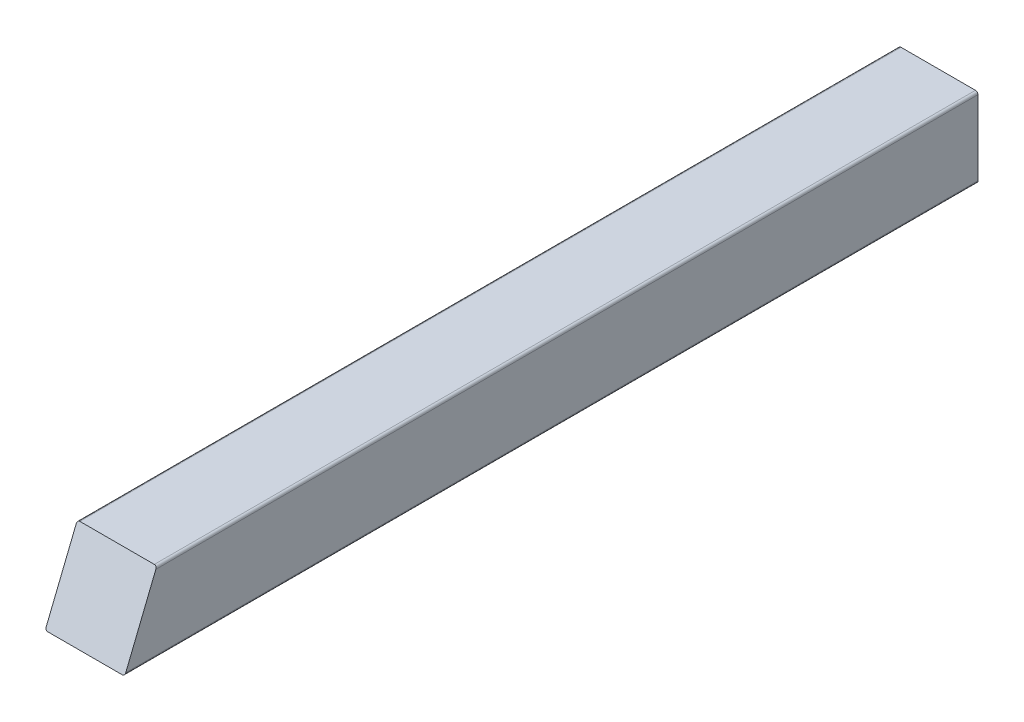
ISO-10303-21;
HEADER;
FILE_DESCRIPTION(('STEP AP214'),'2;1');
FILE_NAME('part.step','',(''),(''),'','','');
FILE_SCHEMA(('AUTOMOTIVE_DESIGN { 1 0 10303 214 1 1 1 1 }'));
ENDSEC;
DATA;
#1=APPLICATION_CONTEXT('core data for automotive mechanical design processes');
#2=APPLICATION_PROTOCOL_DEFINITION('international standard','automotive_design',2000,#1);
#3=PRODUCT_CONTEXT('',#1,'mechanical');
#4=PRODUCT('Part','Part','',(#3));
#5=PRODUCT_RELATED_PRODUCT_CATEGORY('part','',(#4));
#6=PRODUCT_DEFINITION_FORMATION('','',#4);
#7=PRODUCT_DEFINITION_CONTEXT('part definition',#1,'design');
#8=PRODUCT_DEFINITION('design','',#6,#7);
#9=PRODUCT_DEFINITION_SHAPE('','',#8);
#10=(LENGTH_UNIT() NAMED_UNIT(*) SI_UNIT(.MILLI.,.METRE.));
#11=(NAMED_UNIT(*) PLANE_ANGLE_UNIT() SI_UNIT($,.RADIAN.));
#12=(NAMED_UNIT(*) SI_UNIT($,.STERADIAN.) SOLID_ANGLE_UNIT());
#13=UNCERTAINTY_MEASURE_WITH_UNIT(LENGTH_MEASURE(1.E-05),#10,'distance_accuracy_value','');
#14=(GEOMETRIC_REPRESENTATION_CONTEXT(3) GLOBAL_UNCERTAINTY_ASSIGNED_CONTEXT((#13)) GLOBAL_UNIT_ASSIGNED_CONTEXT((#10,
#11,#12)) REPRESENTATION_CONTEXT('',''));
#15=CARTESIAN_POINT('',(0.,0.,0.));
#16=DIRECTION('',(0.,0.,1.));
#17=DIRECTION('',(1.,0.,0.));
#18=AXIS2_PLACEMENT_3D('',#15,#16,#17);
#19=CARTESIAN_POINT('',(47.5,-47.5,1139.62587109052));
#20=DIRECTION('',(-1.,0.,0.));
#21=DIRECTION('',(0.,-1.,0.));
#22=AXIS2_PLACEMENT_3D('',#19,#20,#21);
#23=PLANE('',#22);
#24=DIRECTION('',(0.,1.,0.));
#25=VECTOR('',#24,1.);
#26=CARTESIAN_POINT('',(47.5,-47.5,0.));
#27=LINE('',#26,#25);
#28=CARTESIAN_POINT('',(47.5,-44.5,0.));
#29=VERTEX_POINT('',#28);
#30=CARTESIAN_POINT('',(47.5,44.5,0.));
#31=VERTEX_POINT('',#30);
#32=EDGE_CURVE('E161',#29,#31,#27,.T.);
#33=ORIENTED_EDGE('',*,*,#32,.T.);
#34=DIRECTION('',(0.,0.,-1.));
#35=VECTOR('',#34,1.);
#36=CARTESIAN_POINT('',(47.5,44.5,1139.62587109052));
#37=LINE('',#36,#35);
#38=CARTESIAN_POINT('',(47.5,44.5,982.020832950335));
#39=VERTEX_POINT('',#38);
#40=EDGE_CURVE('E128',#31,#39,#37,.F.);
#41=ORIENTED_EDGE('',*,*,#40,.T.);
#42=DIRECTION('',(0.,0.927183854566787,-0.374606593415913));
#43=VECTOR('',#42,1.);
#44=CARTESIAN_POINT('',(47.5,-89.3304603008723,1036.09184872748));
#45=LINE('',#44,#43);
#46=CARTESIAN_POINT('',(47.5,-44.5,1017.97916704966));
#47=VERTEX_POINT('',#46);
#48=EDGE_CURVE('E97',#47,#39,#45,.T.);
#49=ORIENTED_EDGE('',*,*,#48,.F.);
#50=DIRECTION('',(0.,0.,-1.));
#51=VECTOR('',#50,1.);
#52=CARTESIAN_POINT('',(47.5,-44.5,1139.62587109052));
#53=LINE('',#52,#51);
#54=EDGE_CURVE('E125',#47,#29,#53,.T.);
#55=ORIENTED_EDGE('',*,*,#54,.T.);
#56=EDGE_LOOP('',(#33,#41,#49,#55));
#57=FACE_BOUND('',#56,.T.);
#58=ADVANCED_FACE('F28',(#57),#23,.F.);
#59=CARTESIAN_POINT('',(47.5,47.5,1139.62587109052));
#60=DIRECTION('',(0.,-1.,0.));
#61=DIRECTION('',(0.,0.,-1.));
#62=AXIS2_PLACEMENT_3D('',#59,#60,#61);
#63=PLANE('',#62);
#64=DIRECTION('',(-1.,0.,0.));
#65=VECTOR('',#64,1.);
#66=CARTESIAN_POINT('',(47.5,47.5,980.80875427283));
#67=LINE('',#66,#65);
#68=CARTESIAN_POINT('',(44.5,47.5,980.80875427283));
#69=VERTEX_POINT('',#68);
#70=CARTESIAN_POINT('',(-44.5,47.5,980.80875427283));
#71=VERTEX_POINT('',#70);
#72=EDGE_CURVE('E95',#69,#71,#67,.T.);
#73=ORIENTED_EDGE('',*,*,#72,.F.);
#74=DIRECTION('',(0.,0.,-1.));
#75=VECTOR('',#74,1.);
#76=CARTESIAN_POINT('',(44.5,47.5,1139.62587109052));
#77=LINE('',#76,#75);
#78=CARTESIAN_POINT('',(44.5,47.5,0.));
#79=VERTEX_POINT('',#78);
#80=EDGE_CURVE('E106',#69,#79,#77,.T.);
#81=ORIENTED_EDGE('',*,*,#80,.T.);
#82=DIRECTION('',(-1.,0.,0.));
#83=VECTOR('',#82,1.);
#84=CARTESIAN_POINT('',(47.5,47.5,0.));
#85=LINE('',#84,#83);
#86=CARTESIAN_POINT('',(-44.5,47.5,0.));
#87=VERTEX_POINT('',#86);
#88=EDGE_CURVE('E157',#79,#87,#85,.T.);
#89=ORIENTED_EDGE('',*,*,#88,.T.);
#90=DIRECTION('',(0.,0.,-1.));
#91=VECTOR('',#90,1.);
#92=CARTESIAN_POINT('',(-44.5,47.5,1139.62587109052));
#93=LINE('',#92,#91);
#94=EDGE_CURVE('E109',#87,#71,#93,.F.);
#95=ORIENTED_EDGE('',*,*,#94,.T.);
#96=EDGE_LOOP('',(#73,#81,#89,#95));
#97=FACE_BOUND('',#96,.T.);
#98=ADVANCED_FACE('F104',(#97),#63,.F.);
#99=CARTESIAN_POINT('',(-47.5,-47.5,1139.62587109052));
#100=DIRECTION('',(1.,0.,0.));
#101=DIRECTION('',(0.,0.,-1.));
#102=AXIS2_PLACEMENT_3D('',#99,#100,#101);
#103=PLANE('',#102);
#104=DIRECTION('',(0.,-0.927183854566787,0.374606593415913));
#105=VECTOR('',#104,1.);
#106=CARTESIAN_POINT('',(-47.5,-89.3304603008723,1036.09184872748));
#107=LINE('',#106,#105);
#108=CARTESIAN_POINT('',(-47.5,44.5,982.020832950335));
#109=VERTEX_POINT('',#108);
#110=CARTESIAN_POINT('',(-47.5,-44.5,1017.97916704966));
#111=VERTEX_POINT('',#110);
#112=EDGE_CURVE('E110',#109,#111,#107,.T.);
#113=ORIENTED_EDGE('',*,*,#112,.F.);
#114=DIRECTION('',(0.,0.,-1.));
#115=VECTOR('',#114,1.);
#116=CARTESIAN_POINT('',(-47.5,44.5,1139.62587109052));
#117=LINE('',#116,#115);
#118=CARTESIAN_POINT('',(-47.5,44.5,0.));
#119=VERTEX_POINT('',#118);
#120=EDGE_CURVE('E136',#109,#119,#117,.T.);
#121=ORIENTED_EDGE('',*,*,#120,.T.);
#122=DIRECTION('',(0.,-1.,0.));
#123=VECTOR('',#122,1.);
#124=CARTESIAN_POINT('',(-47.5,-47.5,0.));
#125=LINE('',#124,#123);
#126=CARTESIAN_POINT('',(-47.5,-44.5,0.));
#127=VERTEX_POINT('',#126);
#128=EDGE_CURVE('E155',#119,#127,#125,.T.);
#129=ORIENTED_EDGE('',*,*,#128,.T.);
#130=DIRECTION('',(0.,0.,-1.));
#131=VECTOR('',#130,1.);
#132=CARTESIAN_POINT('',(-47.5,-44.5,1139.62587109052));
#133=LINE('',#132,#131);
#134=EDGE_CURVE('E43',#127,#111,#133,.F.);
#135=ORIENTED_EDGE('',*,*,#134,.T.);
#136=EDGE_LOOP('',(#113,#121,#129,#135));
#137=FACE_BOUND('',#136,.T.);
#138=ADVANCED_FACE('F181',(#137),#103,.F.);
#139=CARTESIAN_POINT('',(47.5,-47.5,1139.62587109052));
#140=DIRECTION('',(0.,1.,0.));
#141=DIRECTION('',(0.,0.,1.));
#142=AXIS2_PLACEMENT_3D('',#139,#140,#141);
#143=PLANE('',#142);
#144=DIRECTION('',(1.,0.,0.));
#145=VECTOR('',#144,1.);
#146=CARTESIAN_POINT('',(47.5,-47.5,0.));
#147=LINE('',#146,#145);
#148=CARTESIAN_POINT('',(-44.5,-47.5,0.));
#149=VERTEX_POINT('',#148);
#150=CARTESIAN_POINT('',(44.5,-47.5,0.));
#151=VERTEX_POINT('',#150);
#152=EDGE_CURVE('E145',#149,#151,#147,.T.);
#153=ORIENTED_EDGE('',*,*,#152,.T.);
#154=DIRECTION('',(0.,0.,-1.));
#155=VECTOR('',#154,1.);
#156=CARTESIAN_POINT('',(44.5,-47.5,1139.62587109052));
#157=LINE('',#156,#155);
#158=CARTESIAN_POINT('',(44.5,-47.5,1019.19124572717));
#159=VERTEX_POINT('',#158);
#160=EDGE_CURVE('E11',#151,#159,#157,.F.);
#161=ORIENTED_EDGE('',*,*,#160,.T.);
#162=DIRECTION('',(1.,0.,0.));
#163=VECTOR('',#162,1.);
#164=CARTESIAN_POINT('',(47.5,-47.5,1019.19124572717));
#165=LINE('',#164,#163);
#166=CARTESIAN_POINT('',(-44.5,-47.5,1019.19124572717));
#167=VERTEX_POINT('',#166);
#168=EDGE_CURVE('E148',#167,#159,#165,.T.);
#169=ORIENTED_EDGE('',*,*,#168,.F.);
#170=DIRECTION('',(0.,0.,-1.));
#171=VECTOR('',#170,1.);
#172=CARTESIAN_POINT('',(-44.5,-47.5,1139.62587109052));
#173=LINE('',#172,#171);
#174=EDGE_CURVE('E36',#167,#149,#173,.T.);
#175=ORIENTED_EDGE('',*,*,#174,.T.);
#176=EDGE_LOOP('',(#153,#161,#169,#175));
#177=FACE_BOUND('',#176,.T.);
#178=ADVANCED_FACE('F144',(#177),#143,.F.);
#179=CARTESIAN_POINT('',(47.5,47.5,0.));
#180=DIRECTION('',(0.,0.,1.));
#181=DIRECTION('',(1.,0.,0.));
#182=AXIS2_PLACEMENT_3D('',#179,#180,#181);
#183=PLANE('',#182);
#184=ORIENTED_EDGE('',*,*,#88,.F.);
#185=CARTESIAN_POINT('',(44.5,44.5,0.));
#186=DIRECTION('',(0.,0.,1.));
#187=DIRECTION('',(1.,0.,0.));
#188=AXIS2_PLACEMENT_3D('',#185,#186,#187);
#189=CIRCLE('',#188,3.);
#190=EDGE_CURVE('E113',#79,#31,#189,.F.);
#191=ORIENTED_EDGE('',*,*,#190,.T.);
#192=ORIENTED_EDGE('',*,*,#32,.F.);
#193=CARTESIAN_POINT('',(44.5,-44.5,0.));
#194=DIRECTION('',(0.,0.,1.));
#195=DIRECTION('',(1.,0.,0.));
#196=AXIS2_PLACEMENT_3D('',#193,#194,#195);
#197=CIRCLE('',#196,3.);
#198=EDGE_CURVE('E116',#29,#151,#197,.F.);
#199=ORIENTED_EDGE('',*,*,#198,.T.);
#200=ORIENTED_EDGE('',*,*,#152,.F.);
#201=CARTESIAN_POINT('',(-44.5,-44.5,0.));
#202=DIRECTION('',(0.,0.,1.));
#203=DIRECTION('',(1.,0.,0.));
#204=AXIS2_PLACEMENT_3D('',#201,#202,#203);
#205=CIRCLE('',#204,3.);
#206=EDGE_CURVE('E114',#149,#127,#205,.F.);
#207=ORIENTED_EDGE('',*,*,#206,.T.);
#208=ORIENTED_EDGE('',*,*,#128,.F.);
#209=CARTESIAN_POINT('',(-44.5,44.5,0.));
#210=DIRECTION('',(0.,0.,1.));
#211=DIRECTION('',(1.,0.,0.));
#212=AXIS2_PLACEMENT_3D('',#209,#210,#211);
#213=CIRCLE('',#212,3.);
#214=EDGE_CURVE('E122',#119,#87,#213,.F.);
#215=ORIENTED_EDGE('',*,*,#214,.T.);
#216=EDGE_LOOP('',(#184,#191,#192,#199,#200,#207,#208,#215));
#217=FACE_BOUND('',#216,.T.);
#218=ADVANCED_FACE('F152',(#217),#183,.F.);
#219=CARTESIAN_POINT('',(0.,347.3291852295,859.669900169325));
#220=DIRECTION('',(0.,0.374606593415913,0.927183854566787));
#221=DIRECTION('',(0.,-0.927183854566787,0.374606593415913));
#222=AXIS2_PLACEMENT_3D('',#219,#220,#221);
#223=PLANE('',#222);
#224=ORIENTED_EDGE('',*,*,#48,.T.);
#225=CARTESIAN_POINT('',(44.5,44.5,982.020832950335));
#226=DIRECTION('',(0.,0.374606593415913,0.927183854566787));
#227=DIRECTION('',(0.,0.927183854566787,-0.374606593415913));
#228=AXIS2_PLACEMENT_3D('',#225,#226,#227);
#229=ELLIPSE('',#228,3.23560422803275,3.);
#230=EDGE_CURVE('E93',#39,#69,#229,.T.);
#231=ORIENTED_EDGE('',*,*,#230,.T.);
#232=ORIENTED_EDGE('',*,*,#72,.T.);
#233=CARTESIAN_POINT('',(-44.5,44.5,982.020832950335));
#234=DIRECTION('',(0.,0.374606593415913,0.927183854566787));
#235=DIRECTION('',(0.,0.927183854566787,-0.374606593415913));
#236=AXIS2_PLACEMENT_3D('',#233,#234,#235);
#237=ELLIPSE('',#236,3.23560422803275,3.);
#238=EDGE_CURVE('E50',#71,#109,#237,.T.);
#239=ORIENTED_EDGE('',*,*,#238,.T.);
#240=ORIENTED_EDGE('',*,*,#112,.T.);
#241=CARTESIAN_POINT('',(-44.5,-44.5,1017.97916704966));
#242=DIRECTION('',(0.,0.374606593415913,0.927183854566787));
#243=DIRECTION('',(0.,0.927183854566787,-0.374606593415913));
#244=AXIS2_PLACEMENT_3D('',#241,#242,#243);
#245=ELLIPSE('',#244,3.23560422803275,3.);
#246=EDGE_CURVE('E130',#111,#167,#245,.T.);
#247=ORIENTED_EDGE('',*,*,#246,.T.);
#248=ORIENTED_EDGE('',*,*,#168,.T.);
#249=CARTESIAN_POINT('',(44.5,-44.5,1017.97916704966));
#250=DIRECTION('',(0.,0.374606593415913,0.927183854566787));
#251=DIRECTION('',(0.,0.927183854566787,-0.374606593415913));
#252=AXIS2_PLACEMENT_3D('',#249,#250,#251);
#253=ELLIPSE('',#252,3.23560422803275,3.);
#254=EDGE_CURVE('E132',#159,#47,#253,.T.);
#255=ORIENTED_EDGE('',*,*,#254,.T.);
#256=EDGE_LOOP('',(#224,#231,#232,#239,#240,#247,#248,#255));
#257=FACE_BOUND('',#256,.T.);
#258=ADVANCED_FACE('F30',(#257),#223,.T.);
#259=CARTESIAN_POINT('',(44.5,44.5,1139.62587109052));
#260=DIRECTION('',(0.,0.,-1.));
#261=DIRECTION('',(-1.,0.,0.));
#262=AXIS2_PLACEMENT_3D('',#259,#260,#261);
#263=CYLINDRICAL_SURFACE('',#262,3.);
#264=ORIENTED_EDGE('',*,*,#230,.F.);
#265=ORIENTED_EDGE('',*,*,#40,.F.);
#266=ORIENTED_EDGE('',*,*,#190,.F.);
#267=ORIENTED_EDGE('',*,*,#80,.F.);
#268=EDGE_LOOP('',(#264,#265,#266,#267));
#269=FACE_BOUND('',#268,.T.);
#270=ADVANCED_FACE('F112',(#269),#263,.T.);
#271=CARTESIAN_POINT('',(-44.5,44.5,1139.62587109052));
#272=DIRECTION('',(0.,0.,-1.));
#273=DIRECTION('',(-1.,0.,0.));
#274=AXIS2_PLACEMENT_3D('',#271,#272,#273);
#275=CYLINDRICAL_SURFACE('',#274,3.);
#276=ORIENTED_EDGE('',*,*,#238,.F.);
#277=ORIENTED_EDGE('',*,*,#94,.F.);
#278=ORIENTED_EDGE('',*,*,#214,.F.);
#279=ORIENTED_EDGE('',*,*,#120,.F.);
#280=EDGE_LOOP('',(#276,#277,#278,#279));
#281=FACE_BOUND('',#280,.T.);
#282=ADVANCED_FACE('F173',(#281),#275,.T.);
#283=CARTESIAN_POINT('',(44.5,-44.5,1139.62587109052));
#284=DIRECTION('',(0.,0.,-1.));
#285=DIRECTION('',(-1.,0.,0.));
#286=AXIS2_PLACEMENT_3D('',#283,#284,#285);
#287=CYLINDRICAL_SURFACE('',#286,3.);
#288=ORIENTED_EDGE('',*,*,#254,.F.);
#289=ORIENTED_EDGE('',*,*,#160,.F.);
#290=ORIENTED_EDGE('',*,*,#198,.F.);
#291=ORIENTED_EDGE('',*,*,#54,.F.);
#292=EDGE_LOOP('',(#288,#289,#290,#291));
#293=FACE_BOUND('',#292,.T.);
#294=ADVANCED_FACE('F168',(#293),#287,.T.);
#295=CARTESIAN_POINT('',(-44.5,-44.5,1139.62587109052));
#296=DIRECTION('',(0.,0.,-1.));
#297=DIRECTION('',(-1.,0.,0.));
#298=AXIS2_PLACEMENT_3D('',#295,#296,#297);
#299=CYLINDRICAL_SURFACE('',#298,3.);
#300=ORIENTED_EDGE('',*,*,#246,.F.);
#301=ORIENTED_EDGE('',*,*,#134,.F.);
#302=ORIENTED_EDGE('',*,*,#206,.F.);
#303=ORIENTED_EDGE('',*,*,#174,.F.);
#304=EDGE_LOOP('',(#300,#301,#302,#303));
#305=FACE_BOUND('',#304,.T.);
#306=ADVANCED_FACE('F166',(#305),#299,.T.);
#307=CLOSED_SHELL('',(#58,#98,#138,#178,#218,#258,#270,#282,#294,#306));
#308=MANIFOLD_SOLID_BREP('B2',#307);
#309=ADVANCED_BREP_SHAPE_REPRESENTATION('',(#18,#308),#14);
#310=SHAPE_DEFINITION_REPRESENTATION(#9,#309);
ENDSEC;
END-ISO-10303-21;
